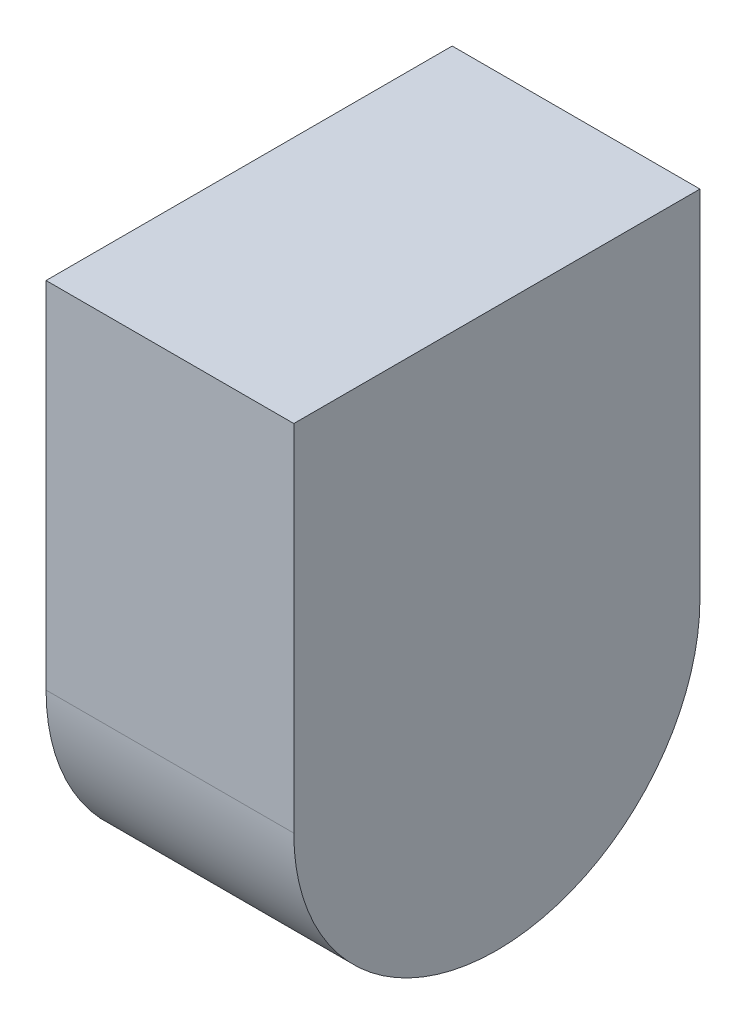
ISO-10303-21;
HEADER;
FILE_DESCRIPTION(('STEP AP214'),'2;1');
FILE_NAME('part.step','',(''),(''),'','','');
FILE_SCHEMA(('AUTOMOTIVE_DESIGN { 1 0 10303 214 1 1 1 1 }'));
ENDSEC;
DATA;
#1=APPLICATION_CONTEXT('core data for automotive mechanical design processes');
#2=APPLICATION_PROTOCOL_DEFINITION('international standard','automotive_design',2000,#1);
#3=PRODUCT_CONTEXT('',#1,'mechanical');
#4=PRODUCT('Part','Part','',(#3));
#5=PRODUCT_RELATED_PRODUCT_CATEGORY('part','',(#4));
#6=PRODUCT_DEFINITION_FORMATION('','',#4);
#7=PRODUCT_DEFINITION_CONTEXT('part definition',#1,'design');
#8=PRODUCT_DEFINITION('design','',#6,#7);
#9=PRODUCT_DEFINITION_SHAPE('','',#8);
#10=(LENGTH_UNIT() NAMED_UNIT(*) SI_UNIT(.MILLI.,.METRE.));
#11=(NAMED_UNIT(*) PLANE_ANGLE_UNIT() SI_UNIT($,.RADIAN.));
#12=(NAMED_UNIT(*) SI_UNIT($,.STERADIAN.) SOLID_ANGLE_UNIT());
#13=UNCERTAINTY_MEASURE_WITH_UNIT(LENGTH_MEASURE(1.E-05),#10,'distance_accuracy_value','');
#14=(GEOMETRIC_REPRESENTATION_CONTEXT(3) GLOBAL_UNCERTAINTY_ASSIGNED_CONTEXT((#13)) GLOBAL_UNIT_ASSIGNED_CONTEXT((#10,
#11,#12)) REPRESENTATION_CONTEXT('',''));
#15=CARTESIAN_POINT('',(0.,0.,0.));
#16=DIRECTION('',(0.,0.,1.));
#17=DIRECTION('',(1.,0.,0.));
#18=AXIS2_PLACEMENT_3D('',#15,#16,#17);
#19=CARTESIAN_POINT('',(18.3,0.,0.));
#20=DIRECTION('',(1.,0.,0.));
#21=DIRECTION('',(0.,0.,-1.));
#22=AXIS2_PLACEMENT_3D('',#19,#20,#21);
#23=PLANE('',#22);
#24=CARTESIAN_POINT('',(18.3,0.,0.));
#25=DIRECTION('',(1.,0.,0.));
#26=DIRECTION('',(0.,0.,-1.));
#27=AXIS2_PLACEMENT_3D('',#24,#25,#26);
#28=CIRCLE('',#27,15.);
#29=CARTESIAN_POINT('',(18.3,0.,15.));
#30=VERTEX_POINT('',#29);
#31=CARTESIAN_POINT('',(18.3,0.,-15.));
#32=VERTEX_POINT('',#31);
#33=EDGE_CURVE('E181',#30,#32,#28,.T.);
#34=ORIENTED_EDGE('',*,*,#33,.T.);
#35=DIRECTION('',(0.,1.,0.));
#36=VECTOR('',#35,1.);
#37=CARTESIAN_POINT('',(18.3,0.,-15.));
#38=LINE('',#37,#36);
#39=CARTESIAN_POINT('',(18.3,26.2,-15.));
#40=VERTEX_POINT('',#39);
#41=EDGE_CURVE('E186',#32,#40,#38,.T.);
#42=ORIENTED_EDGE('',*,*,#41,.T.);
#43=DIRECTION('',(0.,0.,1.));
#44=VECTOR('',#43,1.);
#45=CARTESIAN_POINT('',(18.3,26.2,-15.));
#46=LINE('',#45,#44);
#47=CARTESIAN_POINT('',(18.3,26.2,15.));
#48=VERTEX_POINT('',#47);
#49=EDGE_CURVE('E192',#40,#48,#46,.T.);
#50=ORIENTED_EDGE('',*,*,#49,.T.);
#51=DIRECTION('',(0.,-1.,0.));
#52=VECTOR('',#51,1.);
#53=CARTESIAN_POINT('',(18.3,0.,15.));
#54=LINE('',#53,#52);
#55=EDGE_CURVE('E196',#48,#30,#54,.T.);
#56=ORIENTED_EDGE('',*,*,#55,.T.);
#57=EDGE_LOOP('',(#34,#42,#50,#56));
#58=FACE_BOUND('',#57,.T.);
#59=ADVANCED_FACE('F39',(#58),#23,.T.);
#60=CARTESIAN_POINT('',(0.,0.,0.));
#61=DIRECTION('',(1.,0.,0.));
#62=DIRECTION('',(0.,0.,-1.));
#63=AXIS2_PLACEMENT_3D('',#60,#61,#62);
#64=PLANE('',#63);
#65=CARTESIAN_POINT('',(0.,0.,0.));
#66=DIRECTION('',(1.,0.,0.));
#67=DIRECTION('',(0.,0.,-1.));
#68=AXIS2_PLACEMENT_3D('',#65,#66,#67);
#69=CIRCLE('',#68,15.);
#70=CARTESIAN_POINT('',(0.,0.,15.));
#71=VERTEX_POINT('',#70);
#72=CARTESIAN_POINT('',(0.,0.,-15.));
#73=VERTEX_POINT('',#72);
#74=EDGE_CURVE('E183',#71,#73,#69,.T.);
#75=ORIENTED_EDGE('',*,*,#74,.F.);
#76=DIRECTION('',(0.,-1.,0.));
#77=VECTOR('',#76,1.);
#78=CARTESIAN_POINT('',(0.,26.2,15.));
#79=LINE('',#78,#77);
#80=CARTESIAN_POINT('',(0.,26.2,15.));
#81=VERTEX_POINT('',#80);
#82=EDGE_CURVE('E326',#81,#71,#79,.T.);
#83=ORIENTED_EDGE('',*,*,#82,.F.);
#84=DIRECTION('',(0.,0.,1.));
#85=VECTOR('',#84,1.);
#86=CARTESIAN_POINT('',(0.,26.2,-15.));
#87=LINE('',#86,#85);
#88=CARTESIAN_POINT('',(0.,26.2,-15.));
#89=VERTEX_POINT('',#88);
#90=EDGE_CURVE('E324',#89,#81,#87,.T.);
#91=ORIENTED_EDGE('',*,*,#90,.F.);
#92=DIRECTION('',(0.,1.,0.));
#93=VECTOR('',#92,1.);
#94=CARTESIAN_POINT('',(0.,0.,-15.));
#95=LINE('',#94,#93);
#96=EDGE_CURVE('E322',#73,#89,#95,.T.);
#97=ORIENTED_EDGE('',*,*,#96,.F.);
#98=EDGE_LOOP('',(#75,#83,#91,#97));
#99=FACE_BOUND('',#98,.T.);
#100=ADVANCED_FACE('F337',(#99),#64,.F.);
#101=CARTESIAN_POINT('',(1.,26.2,15.));
#102=DIRECTION('',(0.,0.,-1.));
#103=DIRECTION('',(-1.,0.,0.));
#104=AXIS2_PLACEMENT_3D('',#101,#102,#103);
#105=PLANE('',#104);
#106=ORIENTED_EDGE('',*,*,#82,.T.);
#107=DIRECTION('',(-1.,0.,0.));
#108=VECTOR('',#107,1.);
#109=CARTESIAN_POINT('',(1.,0.,15.));
#110=LINE('',#109,#108);
#111=EDGE_CURVE('E328',#30,#71,#110,.T.);
#112=ORIENTED_EDGE('',*,*,#111,.F.);
#113=ORIENTED_EDGE('',*,*,#55,.F.);
#114=DIRECTION('',(-1.,0.,0.));
#115=VECTOR('',#114,1.);
#116=CARTESIAN_POINT('',(1.,26.2,15.));
#117=LINE('',#116,#115);
#118=EDGE_CURVE('E330',#48,#81,#117,.T.);
#119=ORIENTED_EDGE('',*,*,#118,.T.);
#120=EDGE_LOOP('',(#106,#112,#113,#119));
#121=FACE_BOUND('',#120,.T.);
#122=ADVANCED_FACE('F339',(#121),#105,.F.);
#123=CARTESIAN_POINT('',(1.,26.2,-15.));
#124=DIRECTION('',(0.,-1.,0.));
#125=DIRECTION('',(0.,0.,-1.));
#126=AXIS2_PLACEMENT_3D('',#123,#124,#125);
#127=PLANE('',#126);
#128=ORIENTED_EDGE('',*,*,#90,.T.);
#129=ORIENTED_EDGE('',*,*,#118,.F.);
#130=ORIENTED_EDGE('',*,*,#49,.F.);
#131=DIRECTION('',(-1.,0.,0.));
#132=VECTOR('',#131,1.);
#133=CARTESIAN_POINT('',(1.,26.2,-15.));
#134=LINE('',#133,#132);
#135=EDGE_CURVE('E48',#40,#89,#134,.T.);
#136=ORIENTED_EDGE('',*,*,#135,.T.);
#137=EDGE_LOOP('',(#128,#129,#130,#136));
#138=FACE_BOUND('',#137,.T.);
#139=ADVANCED_FACE('F334',(#138),#127,.F.);
#140=CARTESIAN_POINT('',(1.,0.,-15.));
#141=DIRECTION('',(0.,0.,1.));
#142=DIRECTION('',(1.,0.,0.));
#143=AXIS2_PLACEMENT_3D('',#140,#141,#142);
#144=PLANE('',#143);
#145=ORIENTED_EDGE('',*,*,#96,.T.);
#146=ORIENTED_EDGE('',*,*,#135,.F.);
#147=ORIENTED_EDGE('',*,*,#41,.F.);
#148=DIRECTION('',(-1.,0.,0.));
#149=VECTOR('',#148,1.);
#150=CARTESIAN_POINT('',(1.,0.,-15.));
#151=LINE('',#150,#149);
#152=EDGE_CURVE('E11',#32,#73,#151,.T.);
#153=ORIENTED_EDGE('',*,*,#152,.T.);
#154=EDGE_LOOP('',(#145,#146,#147,#153));
#155=FACE_BOUND('',#154,.T.);
#156=ADVANCED_FACE('F187',(#155),#144,.F.);
#157=CARTESIAN_POINT('',(1.,0.,0.));
#158=DIRECTION('',(-1.,0.,0.));
#159=DIRECTION('',(0.,0.,1.));
#160=AXIS2_PLACEMENT_3D('',#157,#158,#159);
#161=CYLINDRICAL_SURFACE('',#160,15.);
#162=ORIENTED_EDGE('',*,*,#74,.T.);
#163=ORIENTED_EDGE('',*,*,#152,.F.);
#164=ORIENTED_EDGE('',*,*,#33,.F.);
#165=ORIENTED_EDGE('',*,*,#111,.T.);
#166=EDGE_LOOP('',(#162,#163,#164,#165));
#167=FACE_BOUND('',#166,.T.);
#168=ADVANCED_FACE('F41',(#167),#161,.T.);
#169=CLOSED_SHELL('',(#59,#100,#122,#139,#156,#168));
#170=CARTESIAN_POINT('',(15.6,0.,0.));
#171=DIRECTION('',(-1.,0.,0.));
#172=DIRECTION('',(0.,0.,1.));
#173=AXIS2_PLACEMENT_3D('',#170,#171,#172);
#174=CYLINDRICAL_SURFACE('',#173,14.);
#175=CARTESIAN_POINT('',(1.,0.,0.));
#176=DIRECTION('',(1.,0.,0.));
#177=DIRECTION('',(0.,0.,-1.));
#178=AXIS2_PLACEMENT_3D('',#175,#176,#177);
#179=CIRCLE('',#178,14.);
#180=CARTESIAN_POINT('',(1.,0.,14.));
#181=VERTEX_POINT('',#180);
#182=CARTESIAN_POINT('',(1.,0.,-14.));
#183=VERTEX_POINT('',#182);
#184=EDGE_CURVE('E289',#181,#183,#179,.T.);
#185=ORIENTED_EDGE('',*,*,#184,.F.);
#186=DIRECTION('',(-1.,0.,0.));
#187=VECTOR('',#186,1.);
#188=CARTESIAN_POINT('',(15.6,0.,14.));
#189=LINE('',#188,#187);
#190=CARTESIAN_POINT('',(15.6,0.,14.));
#191=VERTEX_POINT('',#190);
#192=EDGE_CURVE('E303',#191,#181,#189,.T.);
#193=ORIENTED_EDGE('',*,*,#192,.F.);
#194=CARTESIAN_POINT('',(15.6,0.,0.));
#195=DIRECTION('',(1.,0.,0.));
#196=DIRECTION('',(0.,0.,-1.));
#197=AXIS2_PLACEMENT_3D('',#194,#195,#196);
#198=CIRCLE('',#197,14.);
#199=CARTESIAN_POINT('',(15.6,0.,-14.));
#200=VERTEX_POINT('',#199);
#201=EDGE_CURVE('E290',#191,#200,#198,.T.);
#202=ORIENTED_EDGE('',*,*,#201,.T.);
#203=DIRECTION('',(-1.,0.,0.));
#204=VECTOR('',#203,1.);
#205=CARTESIAN_POINT('',(15.6,0.,-14.));
#206=LINE('',#205,#204);
#207=EDGE_CURVE('E318',#200,#183,#206,.T.);
#208=ORIENTED_EDGE('',*,*,#207,.T.);
#209=EDGE_LOOP('',(#185,#193,#202,#208));
#210=FACE_BOUND('',#209,.T.);
#211=ADVANCED_FACE('F417',(#210),#174,.F.);
#212=CARTESIAN_POINT('',(15.6,0.,-14.));
#213=DIRECTION('',(0.,0.,1.));
#214=DIRECTION('',(1.,0.,0.));
#215=AXIS2_PLACEMENT_3D('',#212,#213,#214);
#216=PLANE('',#215);
#217=DIRECTION('',(0.,1.,0.));
#218=VECTOR('',#217,1.);
#219=CARTESIAN_POINT('',(12.1,14.2,-14.));
#220=LINE('',#219,#218);
#221=CARTESIAN_POINT('',(12.1,14.2,-14.));
#222=VERTEX_POINT('',#221);
#223=CARTESIAN_POINT('',(12.1,20.2,-14.));
#224=VERTEX_POINT('',#223);
#225=EDGE_CURVE('E204',#222,#224,#220,.T.);
#226=ORIENTED_EDGE('',*,*,#225,.T.);
#227=DIRECTION('',(1.,0.,0.));
#228=VECTOR('',#227,1.);
#229=CARTESIAN_POINT('',(12.1,20.2,-14.));
#230=LINE('',#229,#228);
#231=CARTESIAN_POINT('',(14.6,20.2,-14.));
#232=VERTEX_POINT('',#231);
#233=EDGE_CURVE('E241',#224,#232,#230,.T.);
#234=ORIENTED_EDGE('',*,*,#233,.T.);
#235=DIRECTION('',(0.,1.,0.));
#236=VECTOR('',#235,1.);
#237=CARTESIAN_POINT('',(14.6,14.2,-14.));
#238=LINE('',#237,#236);
#239=CARTESIAN_POINT('',(14.6,14.2,-14.));
#240=VERTEX_POINT('',#239);
#241=EDGE_CURVE('E222',#240,#232,#238,.T.);
#242=ORIENTED_EDGE('',*,*,#241,.F.);
#243=DIRECTION('',(1.,0.,0.));
#244=VECTOR('',#243,1.);
#245=CARTESIAN_POINT('',(12.1,14.2,-14.));
#246=LINE('',#245,#244);
#247=EDGE_CURVE('E220',#222,#240,#246,.T.);
#248=ORIENTED_EDGE('',*,*,#247,.F.);
#249=EDGE_LOOP('',(#226,#234,#242,#248));
#250=FACE_BOUND('',#249,.T.);
#251=DIRECTION('',(0.,1.,0.));
#252=VECTOR('',#251,1.);
#253=CARTESIAN_POINT('',(9.6,0.,-14.));
#254=LINE('',#253,#252);
#255=CARTESIAN_POINT('',(9.6,14.2,-14.));
#256=VERTEX_POINT('',#255);
#257=CARTESIAN_POINT('',(9.6,20.2,-14.));
#258=VERTEX_POINT('',#257);
#259=EDGE_CURVE('E247',#256,#258,#254,.T.);
#260=ORIENTED_EDGE('',*,*,#259,.F.);
#261=DIRECTION('',(-1.,0.,0.));
#262=VECTOR('',#261,1.);
#263=CARTESIAN_POINT('',(9.6,14.2,-14.));
#264=LINE('',#263,#262);
#265=CARTESIAN_POINT('',(3.6,14.2,-14.));
#266=VERTEX_POINT('',#265);
#267=EDGE_CURVE('E286',#256,#266,#264,.T.);
#268=ORIENTED_EDGE('',*,*,#267,.T.);
#269=DIRECTION('',(0.,1.,0.));
#270=VECTOR('',#269,1.);
#271=CARTESIAN_POINT('',(3.6,0.,-14.));
#272=LINE('',#271,#270);
#273=CARTESIAN_POINT('',(3.6,20.2,-14.));
#274=VERTEX_POINT('',#273);
#275=EDGE_CURVE('E261',#266,#274,#272,.T.);
#276=ORIENTED_EDGE('',*,*,#275,.T.);
#277=DIRECTION('',(-1.,0.,0.));
#278=VECTOR('',#277,1.);
#279=CARTESIAN_POINT('',(9.6,20.2,-14.));
#280=LINE('',#279,#278);
#281=EDGE_CURVE('E283',#258,#274,#280,.T.);
#282=ORIENTED_EDGE('',*,*,#281,.F.);
#283=EDGE_LOOP('',(#260,#268,#276,#282));
#284=FACE_BOUND('',#283,.T.);
#285=DIRECTION('',(0.,1.,0.));
#286=VECTOR('',#285,1.);
#287=CARTESIAN_POINT('',(1.,0.,-14.));
#288=LINE('',#287,#286);
#289=CARTESIAN_POINT('',(1.,25.2,-14.));
#290=VERTEX_POINT('',#289);
#291=EDGE_CURVE('E305',#183,#290,#288,.T.);
#292=ORIENTED_EDGE('',*,*,#291,.F.);
#293=ORIENTED_EDGE('',*,*,#207,.F.);
#294=DIRECTION('',(0.,1.,0.));
#295=VECTOR('',#294,1.);
#296=CARTESIAN_POINT('',(15.6,0.,-14.));
#297=LINE('',#296,#295);
#298=CARTESIAN_POINT('',(15.6,25.2,-14.));
#299=VERTEX_POINT('',#298);
#300=EDGE_CURVE('E293',#200,#299,#297,.T.);
#301=ORIENTED_EDGE('',*,*,#300,.T.);
#302=DIRECTION('',(-1.,0.,0.));
#303=VECTOR('',#302,1.);
#304=CARTESIAN_POINT('',(15.6,25.2,-14.));
#305=LINE('',#304,#303);
#306=EDGE_CURVE('E315',#299,#290,#305,.T.);
#307=ORIENTED_EDGE('',*,*,#306,.T.);
#308=EDGE_LOOP('',(#292,#293,#301,#307));
#309=FACE_BOUND('',#308,.T.);
#310=ADVANCED_FACE('F413',(#250,#284,#309),#216,.T.);
#311=CARTESIAN_POINT('',(15.6,25.2,-14.));
#312=DIRECTION('',(0.,-1.,0.));
#313=DIRECTION('',(0.,0.,-1.));
#314=AXIS2_PLACEMENT_3D('',#311,#312,#313);
#315=PLANE('',#314);
#316=DIRECTION('',(0.,0.,1.));
#317=VECTOR('',#316,1.);
#318=CARTESIAN_POINT('',(1.,25.2,-14.));
#319=LINE('',#318,#317);
#320=CARTESIAN_POINT('',(1.,25.2,14.));
#321=VERTEX_POINT('',#320);
#322=EDGE_CURVE('E307',#290,#321,#319,.T.);
#323=ORIENTED_EDGE('',*,*,#322,.F.);
#324=ORIENTED_EDGE('',*,*,#306,.F.);
#325=DIRECTION('',(0.,0.,1.));
#326=VECTOR('',#325,1.);
#327=CARTESIAN_POINT('',(15.6,25.2,-14.));
#328=LINE('',#327,#326);
#329=CARTESIAN_POINT('',(15.6,25.2,14.));
#330=VERTEX_POINT('',#329);
#331=EDGE_CURVE('E297',#299,#330,#328,.T.);
#332=ORIENTED_EDGE('',*,*,#331,.T.);
#333=DIRECTION('',(-1.,0.,0.));
#334=VECTOR('',#333,1.);
#335=CARTESIAN_POINT('',(15.6,25.2,14.));
#336=LINE('',#335,#334);
#337=EDGE_CURVE('E312',#330,#321,#336,.T.);
#338=ORIENTED_EDGE('',*,*,#337,.T.);
#339=EDGE_LOOP('',(#323,#324,#332,#338));
#340=FACE_BOUND('',#339,.T.);
#341=ADVANCED_FACE('F409',(#340),#315,.T.);
#342=CARTESIAN_POINT('',(15.6,25.2,14.));
#343=DIRECTION('',(0.,0.,-1.));
#344=DIRECTION('',(-1.,0.,0.));
#345=AXIS2_PLACEMENT_3D('',#342,#343,#344);
#346=PLANE('',#345);
#347=DIRECTION('',(0.,-1.,0.));
#348=VECTOR('',#347,1.);
#349=CARTESIAN_POINT('',(12.1,20.2,14.));
#350=LINE('',#349,#348);
#351=CARTESIAN_POINT('',(12.1,20.2,14.));
#352=VERTEX_POINT('',#351);
#353=CARTESIAN_POINT('',(12.1,14.2,14.));
#354=VERTEX_POINT('',#353);
#355=EDGE_CURVE('E211',#352,#354,#350,.T.);
#356=ORIENTED_EDGE('',*,*,#355,.T.);
#357=DIRECTION('',(1.,0.,0.));
#358=VECTOR('',#357,1.);
#359=CARTESIAN_POINT('',(12.1,14.2,14.));
#360=LINE('',#359,#358);
#361=CARTESIAN_POINT('',(14.6,14.2,14.));
#362=VERTEX_POINT('',#361);
#363=EDGE_CURVE('E236',#354,#362,#360,.T.);
#364=ORIENTED_EDGE('',*,*,#363,.T.);
#365=DIRECTION('',(0.,-1.,0.));
#366=VECTOR('',#365,1.);
#367=CARTESIAN_POINT('',(14.6,20.2,14.));
#368=LINE('',#367,#366);
#369=CARTESIAN_POINT('',(14.6,20.2,14.));
#370=VERTEX_POINT('',#369);
#371=EDGE_CURVE('E225',#370,#362,#368,.T.);
#372=ORIENTED_EDGE('',*,*,#371,.F.);
#373=DIRECTION('',(1.,0.,0.));
#374=VECTOR('',#373,1.);
#375=CARTESIAN_POINT('',(12.1,20.2,14.));
#376=LINE('',#375,#374);
#377=EDGE_CURVE('E239',#352,#370,#376,.T.);
#378=ORIENTED_EDGE('',*,*,#377,.F.);
#379=EDGE_LOOP('',(#356,#364,#372,#378));
#380=FACE_BOUND('',#379,.T.);
#381=DIRECTION('',(0.,-1.,0.));
#382=VECTOR('',#381,1.);
#383=CARTESIAN_POINT('',(9.6,0.,14.));
#384=LINE('',#383,#382);
#385=CARTESIAN_POINT('',(9.6,20.2,14.));
#386=VERTEX_POINT('',#385);
#387=CARTESIAN_POINT('',(9.6,14.2,14.));
#388=VERTEX_POINT('',#387);
#389=EDGE_CURVE('E252',#386,#388,#384,.T.);
#390=ORIENTED_EDGE('',*,*,#389,.F.);
#391=DIRECTION('',(-1.,0.,0.));
#392=VECTOR('',#391,1.);
#393=CARTESIAN_POINT('',(9.6,20.2,14.));
#394=LINE('',#393,#392);
#395=CARTESIAN_POINT('',(3.6,20.2,14.));
#396=VERTEX_POINT('',#395);
#397=EDGE_CURVE('E280',#386,#396,#394,.T.);
#398=ORIENTED_EDGE('',*,*,#397,.T.);
#399=DIRECTION('',(0.,-1.,0.));
#400=VECTOR('',#399,1.);
#401=CARTESIAN_POINT('',(3.6,0.,14.));
#402=LINE('',#401,#400);
#403=CARTESIAN_POINT('',(3.6,14.2,14.));
#404=VERTEX_POINT('',#403);
#405=EDGE_CURVE('E266',#396,#404,#402,.T.);
#406=ORIENTED_EDGE('',*,*,#405,.T.);
#407=DIRECTION('',(-1.,0.,0.));
#408=VECTOR('',#407,1.);
#409=CARTESIAN_POINT('',(9.6,14.2,14.));
#410=LINE('',#409,#408);
#411=EDGE_CURVE('E277',#388,#404,#410,.T.);
#412=ORIENTED_EDGE('',*,*,#411,.F.);
#413=EDGE_LOOP('',(#390,#398,#406,#412));
#414=FACE_BOUND('',#413,.T.);
#415=DIRECTION('',(0.,-1.,0.));
#416=VECTOR('',#415,1.);
#417=CARTESIAN_POINT('',(1.,25.2,14.));
#418=LINE('',#417,#416);
#419=EDGE_CURVE('E294',#321,#181,#418,.T.);
#420=ORIENTED_EDGE('',*,*,#419,.F.);
#421=ORIENTED_EDGE('',*,*,#337,.F.);
#422=DIRECTION('',(0.,-1.,0.));
#423=VECTOR('',#422,1.);
#424=CARTESIAN_POINT('',(15.6,25.2,14.));
#425=LINE('',#424,#423);
#426=EDGE_CURVE('E300',#330,#191,#425,.T.);
#427=ORIENTED_EDGE('',*,*,#426,.T.);
#428=ORIENTED_EDGE('',*,*,#192,.T.);
#429=EDGE_LOOP('',(#420,#421,#427,#428));
#430=FACE_BOUND('',#429,.T.);
#431=ADVANCED_FACE('F406',(#380,#414,#430),#346,.T.);
#432=CARTESIAN_POINT('',(1.,0.,0.));
#433=DIRECTION('',(1.,0.,0.));
#434=DIRECTION('',(0.,0.,-1.));
#435=AXIS2_PLACEMENT_3D('',#432,#433,#434);
#436=PLANE('',#435);
#437=ORIENTED_EDGE('',*,*,#184,.T.);
#438=ORIENTED_EDGE('',*,*,#291,.T.);
#439=ORIENTED_EDGE('',*,*,#322,.T.);
#440=ORIENTED_EDGE('',*,*,#419,.T.);
#441=EDGE_LOOP('',(#437,#438,#439,#440));
#442=FACE_BOUND('',#441,.T.);
#443=ADVANCED_FACE('F404',(#442),#436,.T.);
#444=CARTESIAN_POINT('',(9.6,0.0999999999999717,0.0999999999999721));
#445=DIRECTION('',(0.,0.707106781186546,0.707106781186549));
#446=DIRECTION('',(0.,-0.707106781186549,0.707106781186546));
#447=AXIS2_PLACEMENT_3D('',#444,#445,#446);
#448=PLANE('',#447);
#449=DIRECTION('',(0.,0.707106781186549,-0.707106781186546));
#450=VECTOR('',#449,1.);
#451=CARTESIAN_POINT('',(3.6,0.0999999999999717,0.0999999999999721));
#452=LINE('',#451,#450);
#453=CARTESIAN_POINT('',(3.6,8.69999999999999,-8.50000000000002));
#454=VERTEX_POINT('',#453);
#455=EDGE_CURVE('E233',#454,#266,#452,.T.);
#456=ORIENTED_EDGE('',*,*,#455,.T.);
#457=ORIENTED_EDGE('',*,*,#267,.F.);
#458=DIRECTION('',(0.,0.707106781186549,-0.707106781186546));
#459=VECTOR('',#458,1.);
#460=CARTESIAN_POINT('',(9.6,0.0999999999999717,0.0999999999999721));
#461=LINE('',#460,#459);
#462=CARTESIAN_POINT('',(9.6,8.69999999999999,-8.50000000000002));
#463=VERTEX_POINT('',#462);
#464=EDGE_CURVE('E245',#463,#256,#461,.T.);
#465=ORIENTED_EDGE('',*,*,#464,.F.);
#466=DIRECTION('',(-1.,0.,0.));
#467=VECTOR('',#466,1.);
#468=CARTESIAN_POINT('',(9.6,8.69999999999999,-8.50000000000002));
#469=LINE('',#468,#467);
#470=EDGE_CURVE('E258',#463,#454,#469,.T.);
#471=ORIENTED_EDGE('',*,*,#470,.T.);
#472=EDGE_LOOP('',(#456,#457,#465,#471));
#473=FACE_BOUND('',#472,.T.);
#474=ADVANCED_FACE('F400',(#473),#448,.F.);
#475=CARTESIAN_POINT('',(9.6,20.2,0.));
#476=DIRECTION('',(0.,-1.,0.));
#477=DIRECTION('',(0.,0.,-1.));
#478=AXIS2_PLACEMENT_3D('',#475,#476,#477);
#479=PLANE('',#478);
#480=DIRECTION('',(0.,0.,1.));
#481=VECTOR('',#480,1.);
#482=CARTESIAN_POINT('',(3.6,20.2,0.));
#483=LINE('',#482,#481);
#484=EDGE_CURVE('E264',#274,#396,#483,.T.);
#485=ORIENTED_EDGE('',*,*,#484,.T.);
#486=ORIENTED_EDGE('',*,*,#397,.F.);
#487=DIRECTION('',(0.,0.,1.));
#488=VECTOR('',#487,1.);
#489=CARTESIAN_POINT('',(9.6,20.2,0.));
#490=LINE('',#489,#488);
#491=EDGE_CURVE('E250',#258,#386,#490,.T.);
#492=ORIENTED_EDGE('',*,*,#491,.F.);
#493=ORIENTED_EDGE('',*,*,#281,.T.);
#494=EDGE_LOOP('',(#485,#486,#492,#493));
#495=FACE_BOUND('',#494,.T.);
#496=ADVANCED_FACE('F396',(#495),#479,.F.);
#497=CARTESIAN_POINT('',(9.6,0.0999999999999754,-0.0999999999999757));
#498=DIRECTION('',(0.,0.707106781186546,-0.707106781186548));
#499=DIRECTION('',(0.,0.707106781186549,0.707106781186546));
#500=AXIS2_PLACEMENT_3D('',#497,#498,#499);
#501=PLANE('',#500);
#502=DIRECTION('',(0.,-0.707106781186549,-0.707106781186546));
#503=VECTOR('',#502,1.);
#504=CARTESIAN_POINT('',(3.6,0.0999999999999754,-0.0999999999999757));
#505=LINE('',#504,#503);
#506=CARTESIAN_POINT('',(3.6,8.69999999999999,8.50000000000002));
#507=VERTEX_POINT('',#506);
#508=EDGE_CURVE('E269',#404,#507,#505,.T.);
#509=ORIENTED_EDGE('',*,*,#508,.T.);
#510=DIRECTION('',(-1.,0.,0.));
#511=VECTOR('',#510,1.);
#512=CARTESIAN_POINT('',(9.6,8.69999999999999,8.50000000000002));
#513=LINE('',#512,#511);
#514=CARTESIAN_POINT('',(9.6,8.69999999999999,8.50000000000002));
#515=VERTEX_POINT('',#514);
#516=EDGE_CURVE('E274',#515,#507,#513,.T.);
#517=ORIENTED_EDGE('',*,*,#516,.F.);
#518=DIRECTION('',(0.,-0.707106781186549,-0.707106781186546));
#519=VECTOR('',#518,1.);
#520=CARTESIAN_POINT('',(9.6,0.0999999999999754,-0.0999999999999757));
#521=LINE('',#520,#519);
#522=EDGE_CURVE('E254',#388,#515,#521,.T.);
#523=ORIENTED_EDGE('',*,*,#522,.F.);
#524=ORIENTED_EDGE('',*,*,#411,.T.);
#525=EDGE_LOOP('',(#509,#517,#523,#524));
#526=FACE_BOUND('',#525,.T.);
#527=ADVANCED_FACE('F392',(#526),#501,.F.);
#528=CARTESIAN_POINT('',(9.6,8.69999999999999,0.));
#529=DIRECTION('',(0.,1.,0.));
#530=DIRECTION('',(0.,0.,1.));
#531=AXIS2_PLACEMENT_3D('',#528,#529,#530);
#532=PLANE('',#531);
#533=DIRECTION('',(0.,0.,-1.));
#534=VECTOR('',#533,1.);
#535=CARTESIAN_POINT('',(3.6,8.69999999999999,0.));
#536=LINE('',#535,#534);
#537=EDGE_CURVE('E248',#507,#454,#536,.T.);
#538=ORIENTED_EDGE('',*,*,#537,.T.);
#539=ORIENTED_EDGE('',*,*,#470,.F.);
#540=DIRECTION('',(0.,0.,-1.));
#541=VECTOR('',#540,1.);
#542=CARTESIAN_POINT('',(9.6,8.69999999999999,0.));
#543=LINE('',#542,#541);
#544=EDGE_CURVE('E256',#515,#463,#543,.T.);
#545=ORIENTED_EDGE('',*,*,#544,.F.);
#546=ORIENTED_EDGE('',*,*,#516,.T.);
#547=EDGE_LOOP('',(#538,#539,#545,#546));
#548=FACE_BOUND('',#547,.T.);
#549=ADVANCED_FACE('F385',(#548),#532,.F.);
#550=CARTESIAN_POINT('',(9.6,0.,0.));
#551=DIRECTION('',(1.,0.,0.));
#552=DIRECTION('',(0.,0.,-1.));
#553=AXIS2_PLACEMENT_3D('',#550,#551,#552);
#554=PLANE('',#553);
#555=ORIENTED_EDGE('',*,*,#464,.T.);
#556=ORIENTED_EDGE('',*,*,#259,.T.);
#557=ORIENTED_EDGE('',*,*,#491,.T.);
#558=ORIENTED_EDGE('',*,*,#389,.T.);
#559=ORIENTED_EDGE('',*,*,#522,.T.);
#560=ORIENTED_EDGE('',*,*,#544,.T.);
#561=EDGE_LOOP('',(#555,#556,#557,#558,#559,#560));
#562=FACE_BOUND('',#561,.T.);
#563=ADVANCED_FACE('F382',(#562),#554,.T.);
#564=CARTESIAN_POINT('',(3.6,0.,0.));
#565=DIRECTION('',(1.,0.,0.));
#566=DIRECTION('',(0.,0.,-1.));
#567=AXIS2_PLACEMENT_3D('',#564,#565,#566);
#568=PLANE('',#567);
#569=ORIENTED_EDGE('',*,*,#455,.F.);
#570=ORIENTED_EDGE('',*,*,#537,.F.);
#571=ORIENTED_EDGE('',*,*,#508,.F.);
#572=ORIENTED_EDGE('',*,*,#405,.F.);
#573=ORIENTED_EDGE('',*,*,#484,.F.);
#574=ORIENTED_EDGE('',*,*,#275,.F.);
#575=EDGE_LOOP('',(#569,#570,#571,#572,#573,#574));
#576=FACE_BOUND('',#575,.T.);
#577=ADVANCED_FACE('F380',(#576),#568,.F.);
#578=CARTESIAN_POINT('',(12.1,8.69999999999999,-8.50000000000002));
#579=DIRECTION('',(0.,-0.707106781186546,-0.707106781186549));
#580=DIRECTION('',(0.,0.707106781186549,-0.707106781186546));
#581=AXIS2_PLACEMENT_3D('',#578,#579,#580);
#582=PLANE('',#581);
#583=DIRECTION('',(0.,0.707106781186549,-0.707106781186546));
#584=VECTOR('',#583,1.);
#585=CARTESIAN_POINT('',(14.6,8.69999999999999,-8.50000000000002));
#586=LINE('',#585,#584);
#587=CARTESIAN_POINT('',(14.6,8.69999999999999,-8.50000000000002));
#588=VERTEX_POINT('',#587);
#589=EDGE_CURVE('E55',#588,#240,#586,.T.);
#590=ORIENTED_EDGE('',*,*,#589,.F.);
#591=DIRECTION('',(1.,0.,0.));
#592=VECTOR('',#591,1.);
#593=CARTESIAN_POINT('',(12.1,8.69999999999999,-8.50000000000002));
#594=LINE('',#593,#592);
#595=CARTESIAN_POINT('',(12.1,8.69999999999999,-8.50000000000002));
#596=VERTEX_POINT('',#595);
#597=EDGE_CURVE('E231',#596,#588,#594,.T.);
#598=ORIENTED_EDGE('',*,*,#597,.F.);
#599=DIRECTION('',(0.,0.707106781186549,-0.707106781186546));
#600=VECTOR('',#599,1.);
#601=CARTESIAN_POINT('',(12.1,8.69999999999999,-8.50000000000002));
#602=LINE('',#601,#600);
#603=EDGE_CURVE('E201',#596,#222,#602,.T.);
#604=ORIENTED_EDGE('',*,*,#603,.T.);
#605=ORIENTED_EDGE('',*,*,#247,.T.);
#606=EDGE_LOOP('',(#590,#598,#604,#605));
#607=FACE_BOUND('',#606,.T.);
#608=ADVANCED_FACE('F370',(#607),#582,.T.);
#609=CARTESIAN_POINT('',(12.1,8.69999999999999,8.50000000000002));
#610=DIRECTION('',(0.,-1.,0.));
#611=DIRECTION('',(0.,0.,-1.));
#612=AXIS2_PLACEMENT_3D('',#609,#610,#611);
#613=PLANE('',#612);
#614=DIRECTION('',(0.,0.,-1.));
#615=VECTOR('',#614,1.);
#616=CARTESIAN_POINT('',(14.6,8.69999999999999,8.50000000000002));
#617=LINE('',#616,#615);
#618=CARTESIAN_POINT('',(14.6,8.69999999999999,8.50000000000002));
#619=VERTEX_POINT('',#618);
#620=EDGE_CURVE('E205',#619,#588,#617,.T.);
#621=ORIENTED_EDGE('',*,*,#620,.F.);
#622=DIRECTION('',(1.,0.,0.));
#623=VECTOR('',#622,1.);
#624=CARTESIAN_POINT('',(12.1,8.69999999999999,8.50000000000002));
#625=LINE('',#624,#623);
#626=CARTESIAN_POINT('',(12.1,8.69999999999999,8.50000000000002));
#627=VERTEX_POINT('',#626);
#628=EDGE_CURVE('E234',#627,#619,#625,.T.);
#629=ORIENTED_EDGE('',*,*,#628,.F.);
#630=DIRECTION('',(0.,0.,-1.));
#631=VECTOR('',#630,1.);
#632=CARTESIAN_POINT('',(12.1,8.69999999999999,8.50000000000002));
#633=LINE('',#632,#631);
#634=EDGE_CURVE('E217',#627,#596,#633,.T.);
#635=ORIENTED_EDGE('',*,*,#634,.T.);
#636=ORIENTED_EDGE('',*,*,#597,.T.);
#637=EDGE_LOOP('',(#621,#629,#635,#636));
#638=FACE_BOUND('',#637,.T.);
#639=ADVANCED_FACE('F366',(#638),#613,.T.);
#640=CARTESIAN_POINT('',(12.1,14.2,14.));
#641=DIRECTION('',(0.,-0.707106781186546,0.707106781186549));
#642=DIRECTION('',(0.,-0.707106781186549,-0.707106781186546));
#643=AXIS2_PLACEMENT_3D('',#640,#641,#642);
#644=PLANE('',#643);
#645=DIRECTION('',(0.,-0.707106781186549,-0.707106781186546));
#646=VECTOR('',#645,1.);
#647=CARTESIAN_POINT('',(14.6,14.2,14.));
#648=LINE('',#647,#646);
#649=EDGE_CURVE('E227',#362,#619,#648,.T.);
#650=ORIENTED_EDGE('',*,*,#649,.F.);
#651=ORIENTED_EDGE('',*,*,#363,.F.);
#652=DIRECTION('',(0.,-0.707106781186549,-0.707106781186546));
#653=VECTOR('',#652,1.);
#654=CARTESIAN_POINT('',(12.1,14.2,14.));
#655=LINE('',#654,#653);
#656=EDGE_CURVE('E214',#354,#627,#655,.T.);
#657=ORIENTED_EDGE('',*,*,#656,.T.);
#658=ORIENTED_EDGE('',*,*,#628,.T.);
#659=EDGE_LOOP('',(#650,#651,#657,#658));
#660=FACE_BOUND('',#659,.T.);
#661=ADVANCED_FACE('F369',(#660),#644,.T.);
#662=CARTESIAN_POINT('',(12.1,20.2,-14.));
#663=DIRECTION('',(0.,1.,0.));
#664=DIRECTION('',(0.,0.,1.));
#665=AXIS2_PLACEMENT_3D('',#662,#663,#664);
#666=PLANE('',#665);
#667=DIRECTION('',(0.,0.,1.));
#668=VECTOR('',#667,1.);
#669=CARTESIAN_POINT('',(14.6,20.2,-14.));
#670=LINE('',#669,#668);
#671=EDGE_CURVE('E61',#232,#370,#670,.T.);
#672=ORIENTED_EDGE('',*,*,#671,.F.);
#673=ORIENTED_EDGE('',*,*,#233,.F.);
#674=DIRECTION('',(0.,0.,1.));
#675=VECTOR('',#674,1.);
#676=CARTESIAN_POINT('',(12.1,20.2,-14.));
#677=LINE('',#676,#675);
#678=EDGE_CURVE('E208',#224,#352,#677,.T.);
#679=ORIENTED_EDGE('',*,*,#678,.T.);
#680=ORIENTED_EDGE('',*,*,#377,.T.);
#681=EDGE_LOOP('',(#672,#673,#679,#680));
#682=FACE_BOUND('',#681,.T.);
#683=ADVANCED_FACE('F362',(#682),#666,.T.);
#684=CARTESIAN_POINT('',(12.1,0.,0.));
#685=DIRECTION('',(-1.,0.,0.));
#686=DIRECTION('',(0.,0.,1.));
#687=AXIS2_PLACEMENT_3D('',#684,#685,#686);
#688=PLANE('',#687);
#689=ORIENTED_EDGE('',*,*,#603,.F.);
#690=ORIENTED_EDGE('',*,*,#634,.F.);
#691=ORIENTED_EDGE('',*,*,#656,.F.);
#692=ORIENTED_EDGE('',*,*,#355,.F.);
#693=ORIENTED_EDGE('',*,*,#678,.F.);
#694=ORIENTED_EDGE('',*,*,#225,.F.);
#695=EDGE_LOOP('',(#689,#690,#691,#692,#693,#694));
#696=FACE_BOUND('',#695,.T.);
#697=ADVANCED_FACE('F359',(#696),#688,.T.);
#698=CARTESIAN_POINT('',(14.6,0.,0.));
#699=DIRECTION('',(-1.,0.,0.));
#700=DIRECTION('',(0.,0.,1.));
#701=AXIS2_PLACEMENT_3D('',#698,#699,#700);
#702=PLANE('',#701);
#703=ORIENTED_EDGE('',*,*,#589,.T.);
#704=ORIENTED_EDGE('',*,*,#241,.T.);
#705=ORIENTED_EDGE('',*,*,#671,.T.);
#706=ORIENTED_EDGE('',*,*,#371,.T.);
#707=ORIENTED_EDGE('',*,*,#649,.T.);
#708=ORIENTED_EDGE('',*,*,#620,.T.);
#709=EDGE_LOOP('',(#703,#704,#705,#706,#707,#708));
#710=FACE_BOUND('',#709,.T.);
#711=ADVANCED_FACE('F356',(#710),#702,.F.);
#712=CARTESIAN_POINT('',(15.6,0.,0.));
#713=DIRECTION('',(1.,0.,0.));
#714=DIRECTION('',(0.,0.,-1.));
#715=AXIS2_PLACEMENT_3D('',#712,#713,#714);
#716=PLANE('',#715);
#717=ORIENTED_EDGE('',*,*,#201,.F.);
#718=ORIENTED_EDGE('',*,*,#426,.F.);
#719=ORIENTED_EDGE('',*,*,#331,.F.);
#720=ORIENTED_EDGE('',*,*,#300,.F.);
#721=EDGE_LOOP('',(#717,#718,#719,#720));
#722=FACE_BOUND('',#721,.T.);
#723=ADVANCED_FACE('F353',(#722),#716,.F.);
#724=CLOSED_SHELL('',(#211,#310,#341,#431,#443,#474,#496,#527,#549,#563,#577,#608,#639,#661,
#683,#697,#711,#723));
#725=ORIENTED_CLOSED_SHELL('',*,#724,.T.);
#726=BREP_WITH_VOIDS('B2',#169,(#725));
#727=ADVANCED_BREP_SHAPE_REPRESENTATION('',(#18,#726),#14);
#728=SHAPE_DEFINITION_REPRESENTATION(#9,#727);
ENDSEC;
END-ISO-10303-21;
